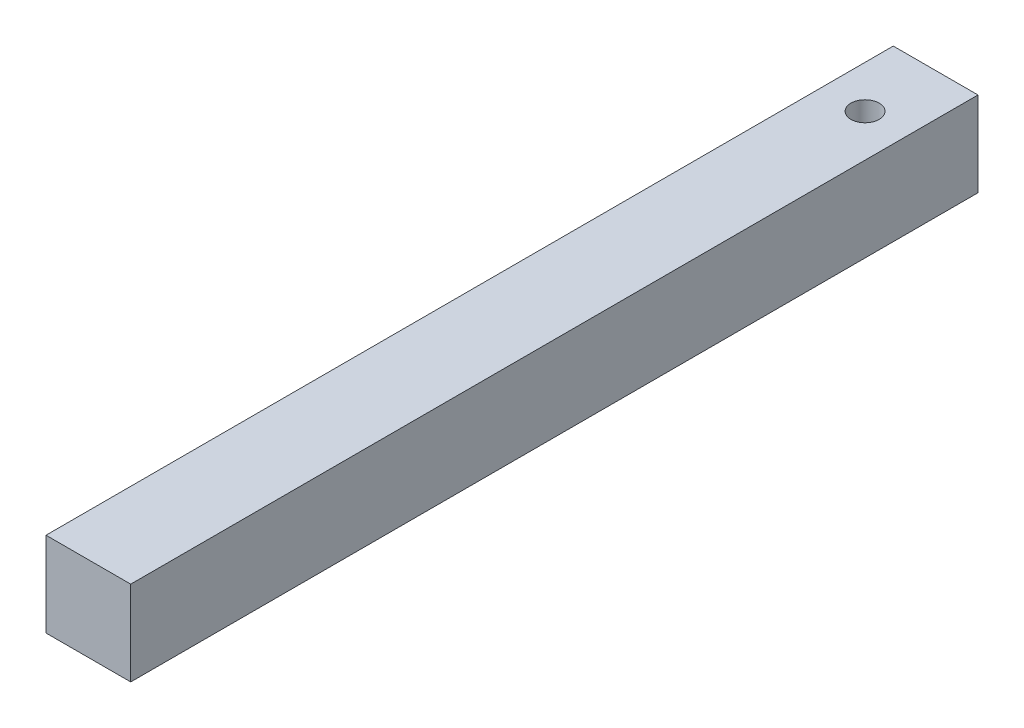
from build123d import *

# Parameters (mm, degrees)
SKETCH1_W          = 19.05
SKETCH1_H          = 190.5
PROFILE_DEPTH      = 19.05
SKETCH10_R         = 3.175
CUT_EXTRUDE1_DEPTH = 41.148


with BuildPart() as part:
    # Sketch1 → Profile (new body)
    with BuildSketch(Plane(origin=(0, 0, 0), x_dir=(1, 0, 0), z_dir=(0, 1, 0))):
        Rectangle(SKETCH1_W, SKETCH1_H)
    extrude(amount=PROFILE_DEPTH)

    # Sketch10 → Cut-Extrude1 (cut)
    with BuildSketch(Plane(origin=(0, 19.05, 0), x_dir=(1, 0, 0), z_dir=(0, 1, 0))):
        with Locations(Location((0, 79.375, 0), (0, 0, 270))):
            Circle(SKETCH10_R)
    extrude(amount=-CUT_EXTRUDE1_DEPTH, mode=Mode.SUBTRACT)


solid = part.part
